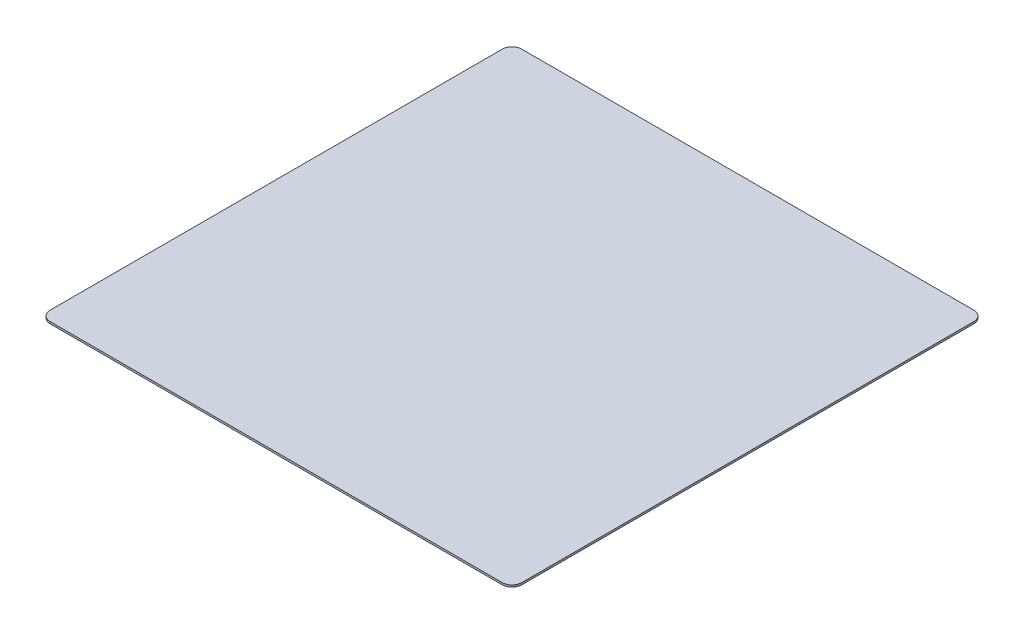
from build123d import *

# Parameters (mm, degrees)
SKETCH1_W           = 24.13
SKETCH1_H           = 24.13
BOSS_EXTRUDE1_DEPTH = 0.1
FILLET1_R           = 0.5


with BuildPart() as part:
    # Sketch1 → Boss-Extrude1 (new body)
    with BuildSketch(Plane(origin=(0, 0, 0), x_dir=(1, 0, 0), z_dir=(0, 1, 0))):
        with Locations((-0.161027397, -6.928013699)):
            Rectangle(SKETCH1_W, SKETCH1_H)
    extrude(amount=BOSS_EXTRUDE1_DEPTH)

    # Fillet1
    fillet1_edges = [part.edges().sort_by_distance(p)[0] for p in [
        (-12.226027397, 0.05, -5.136986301),
        (11.903972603, 0.05, -5.136986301),
        (11.903972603, 0.05, 18.993013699),
        (-12.226027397, 0.05, 18.993013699),
    ]]
    fillet(fillet1_edges, radius=FILLET1_R)


solid = part.part
